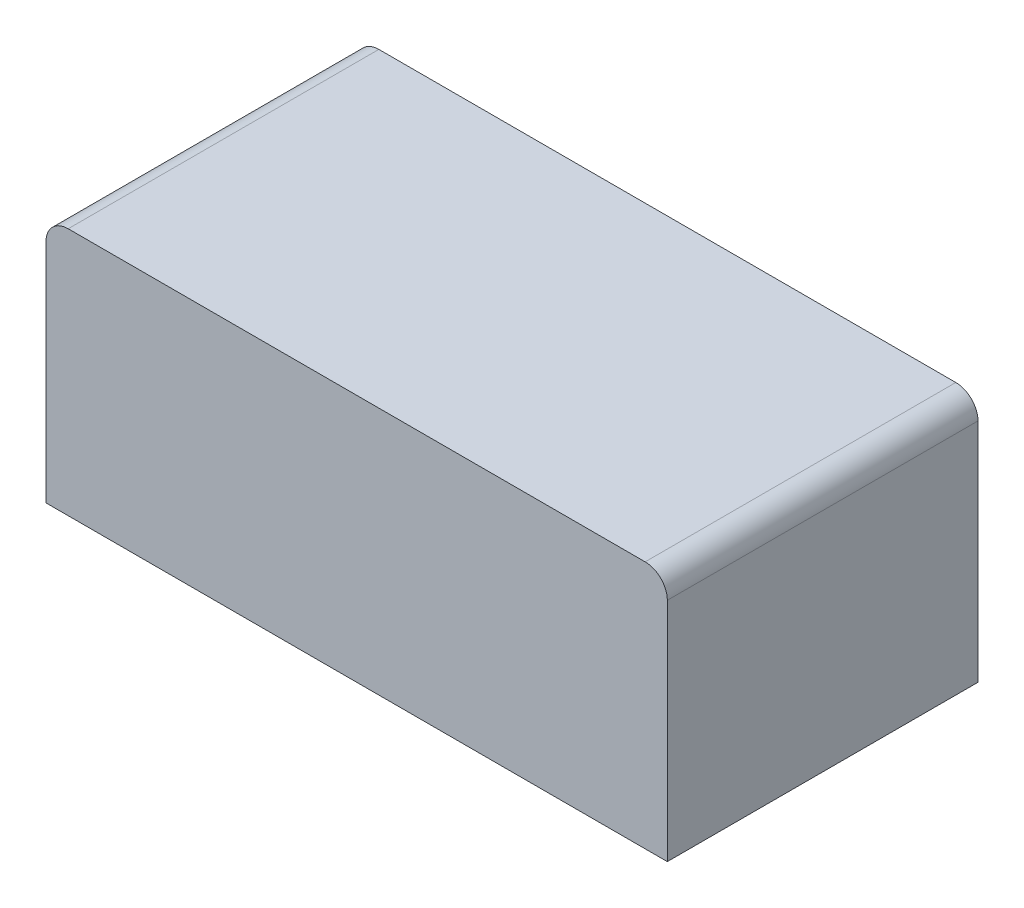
from build123d import *

# Parameters (mm, degrees)
SKETCH1_W           = 2.8
SKETCH1_H           = 1.4
BOSS_EXTRUDE1_DEPTH = 1.12
FILLET1_R           = 0.1


with BuildPart() as part:
    # Sketch1 → Boss-Extrude1 (new body)
    with BuildSketch(Plane(origin=(0, 0, 0), x_dir=(1, 0, 0), z_dir=(0, 1, 0))):
        Rectangle(SKETCH1_W, SKETCH1_H)
    extrude(amount=BOSS_EXTRUDE1_DEPTH)

    # Fillet1
    fillet1_edges = [part.edges().sort_by_distance(p)[0] for p in [
        (-1.4, 1.12, 0),
        (1.4, 1.12, 0),
    ]]
    fillet(fillet1_edges, radius=FILLET1_R)


solid = part.part
